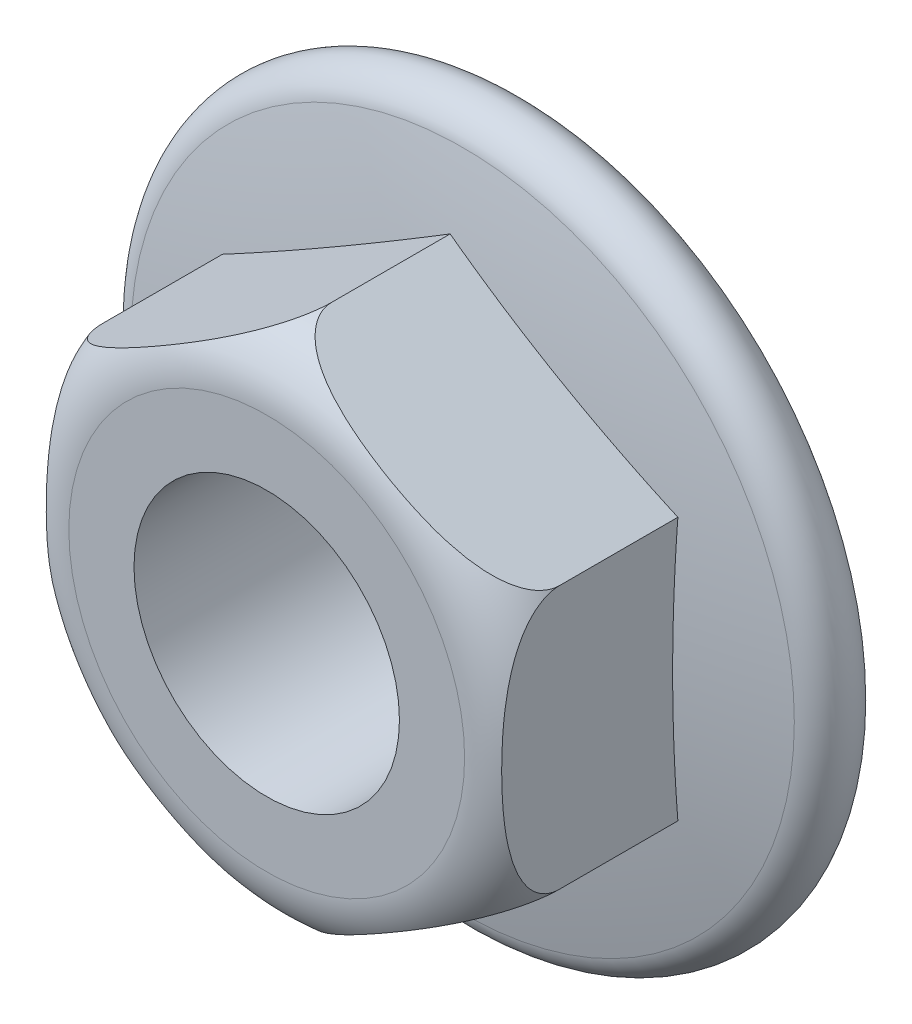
ISO-10303-21;
HEADER;
FILE_DESCRIPTION(('STEP AP214'),'2;1');
FILE_NAME('part.step','',(''),(''),'','','');
FILE_SCHEMA(('AUTOMOTIVE_DESIGN { 1 0 10303 214 1 1 1 1 }'));
ENDSEC;
DATA;
#1=APPLICATION_CONTEXT('core data for automotive mechanical design processes');
#2=APPLICATION_PROTOCOL_DEFINITION('international standard','automotive_design',2000,#1);
#3=PRODUCT_CONTEXT('',#1,'mechanical');
#4=PRODUCT('Part','Part','',(#3));
#5=PRODUCT_RELATED_PRODUCT_CATEGORY('part','',(#4));
#6=PRODUCT_DEFINITION_FORMATION('','',#4);
#7=PRODUCT_DEFINITION_CONTEXT('part definition',#1,'design');
#8=PRODUCT_DEFINITION('design','',#6,#7);
#9=PRODUCT_DEFINITION_SHAPE('','',#8);
#10=(LENGTH_UNIT() NAMED_UNIT(*) SI_UNIT(.MILLI.,.METRE.));
#11=(NAMED_UNIT(*) PLANE_ANGLE_UNIT() SI_UNIT($,.RADIAN.));
#12=(NAMED_UNIT(*) SI_UNIT($,.STERADIAN.) SOLID_ANGLE_UNIT());
#13=UNCERTAINTY_MEASURE_WITH_UNIT(LENGTH_MEASURE(1.E-05),#10,'distance_accuracy_value','');
#14=(GEOMETRIC_REPRESENTATION_CONTEXT(3) GLOBAL_UNCERTAINTY_ASSIGNED_CONTEXT((#13)) GLOBAL_UNIT_ASSIGNED_CONTEXT((#10,
#11,#12)) REPRESENTATION_CONTEXT('',''));
#15=CARTESIAN_POINT('',(0.,0.,0.));
#16=DIRECTION('',(0.,0.,1.));
#17=DIRECTION('',(1.,0.,0.));
#18=AXIS2_PLACEMENT_3D('',#15,#16,#17);
#19=CARTESIAN_POINT('',(-3.50000000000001,2.02072594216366,4.));
#20=DIRECTION('',(-0.500000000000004,0.866025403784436,0.));
#21=DIRECTION('',(-0.866025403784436,-0.500000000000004,0.));
#22=AXIS2_PLACEMENT_3D('',#19,#20,#21);
#23=PLANE('',#22);
#24=DIRECTION('',(0.,0.,-1.));
#25=VECTOR('',#24,1.);
#26=CARTESIAN_POINT('',(-3.50000000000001,2.02072594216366,4.));
#27=LINE('',#26,#25);
#28=CARTESIAN_POINT('',(-3.50000000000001,2.02072594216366,3.));
#29=VERTEX_POINT('',#28);
#30=CARTESIAN_POINT('',(-3.50000000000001,2.02072594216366,1.18087034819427));
#31=VERTEX_POINT('',#30);
#32=EDGE_CURVE('E36',#29,#31,#27,.T.);
#33=ORIENTED_EDGE('',*,*,#32,.F.);
#34=CARTESIAN_POINT('',(-3.499999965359,2.02072596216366,2.9998));
#35=CARTESIAN_POINT('',(-3.50006541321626,2.02068817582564,3.02946004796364));
#36=CARTESIAN_POINT('',(-3.497738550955,2.02203159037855,3.05905658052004));
#37=CARTESIAN_POINT('',(-3.48877331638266,2.02720767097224,3.11713737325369));
#38=CARTESIAN_POINT('',(-3.48216877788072,2.03102080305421,3.14562851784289));
#39=CARTESIAN_POINT('',(-3.46512873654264,2.04085887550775,3.20093447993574));
#40=CARTESIAN_POINT('',(-3.45470238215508,2.04687853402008,3.22775312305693));
#41=CARTESIAN_POINT('',(-3.43063992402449,2.06077100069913,3.27943202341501));
#42=CARTESIAN_POINT('',(-3.41699729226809,2.06864757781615,3.30428815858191));
#43=CARTESIAN_POINT('',(-3.37857137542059,2.09083279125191,3.36543474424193));
#44=CARTESIAN_POINT('',(-3.35188084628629,2.10624257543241,3.40012716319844));
#45=CARTESIAN_POINT('',(-3.2941277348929,2.13958634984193,3.46423943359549));
#46=CARTESIAN_POINT('',(-3.26305460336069,2.15752643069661,3.49364616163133));
#47=CARTESIAN_POINT('',(-3.17696368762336,2.20723104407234,3.56519618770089));
#48=CARTESIAN_POINT('',(-3.11944581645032,2.24043900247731,3.60329409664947));
#49=CARTESIAN_POINT('',(-3.000331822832,2.3092094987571,3.66943708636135));
#50=CARTESIAN_POINT('',(-2.93872771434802,2.34477664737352,3.69746175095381));
#51=CARTESIAN_POINT('',(-2.79342836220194,2.42866526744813,3.75351666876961));
#52=CARTESIAN_POINT('',(-2.70893292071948,2.47744873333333,3.77871981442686));
#53=CARTESIAN_POINT('',(-2.53819605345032,2.57602370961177,3.81977186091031));
#54=CARTESIAN_POINT('',(-2.45195123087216,2.62581718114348,3.83560030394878));
#55=CARTESIAN_POINT('',(-2.27807380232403,2.72620536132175,3.8605608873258));
#56=CARTESIAN_POINT('',(-2.19043561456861,2.77680329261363,3.86963887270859));
#57=CARTESIAN_POINT('',(-2.01497662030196,2.87810459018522,3.88252309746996));
#58=CARTESIAN_POINT('',(-1.92715607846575,2.92880780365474,3.88633451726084));
#59=CARTESIAN_POINT('',(-1.74407122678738,3.03451189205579,3.88956421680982));
#60=CARTESIAN_POINT('',(-1.64880182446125,3.08951570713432,3.88858622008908));
#61=CARTESIAN_POINT('',(-1.45831651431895,3.19949245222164,3.88109833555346));
#62=CARTESIAN_POINT('',(-1.3631007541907,3.25446529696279,3.87458294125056));
#63=CARTESIAN_POINT('',(-1.17405890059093,3.36360866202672,3.85466572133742));
#64=CARTESIAN_POINT('',(-1.08022803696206,3.41778193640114,3.84132691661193));
#65=CARTESIAN_POINT('',(-0.894006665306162,3.52529689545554,3.80514232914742));
#66=CARTESIAN_POINT('',(-0.801613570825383,3.57864007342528,3.78231634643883));
#67=CARTESIAN_POINT('',(-0.663179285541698,3.65856514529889,3.73693902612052));
#68=CARTESIAN_POINT('',(-0.615921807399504,3.68584926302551,3.71938388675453));
#69=CARTESIAN_POINT('',(-0.522814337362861,3.73960488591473,3.67952045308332));
#70=CARTESIAN_POINT('',(-0.47696664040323,3.7660750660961,3.65720483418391));
#71=CARTESIAN_POINT('',(-0.3873121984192,3.81783708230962,3.60659866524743));
#72=CARTESIAN_POINT('',(-0.343524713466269,3.84311779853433,3.57826174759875));
#73=CARTESIAN_POINT('',(-0.25997627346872,3.89135451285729,3.51449392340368));
#74=CARTESIAN_POINT('',(-0.22020674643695,3.91431545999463,3.47907862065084));
#75=CARTESIAN_POINT('',(-0.160686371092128,3.94867956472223,3.41460554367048));
#76=CARTESIAN_POINT('',(-0.138952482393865,3.96122763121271,3.38800019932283));
#77=CARTESIAN_POINT('',(-0.0990712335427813,3.9842530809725,3.33138585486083));
#78=CARTESIAN_POINT('',(-0.0809205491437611,3.99473238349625,3.30138005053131));
#79=CARTESIAN_POINT('',(-0.0516575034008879,4.01162741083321,3.24278652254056));
#80=CARTESIAN_POINT('',(-0.0399052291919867,4.01841258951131,3.21462807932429));
#81=CARTESIAN_POINT('',(-0.0206385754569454,4.02953619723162,3.15645553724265));
#82=CARTESIAN_POINT('',(-0.0131151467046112,4.03387985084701,3.12644555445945));
#83=CARTESIAN_POINT('',(-0.00534902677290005,4.03836362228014,3.08009860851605));
#84=CARTESIAN_POINT('',(-0.00334490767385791,4.03952070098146,3.06413628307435));
#85=CARTESIAN_POINT('',(-0.000665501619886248,4.04106765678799,3.03205266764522));
#86=CARTESIAN_POINT('',(8.84533406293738E-06,4.04145699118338,3.01593127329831));
#87=CARTESIAN_POINT('',(-3.46410176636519E-08,4.04145186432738,2.9998));
#88=B_SPLINE_CURVE_WITH_KNOTS('',3,(#34,#35,#36,#37,#38,#39,#40,#41,#42,#43,#44,#45,#46,#47,#48,
#49,#50,#51,#52,#53,#54,#55,#56,#57,#58,#59,#60,#61,#62,#63,#64,#65,#66,#67,#68,#69,#70,#71,#72,
#73,#74,#75,#76,#77,#78,#79,#80,#81,#82,#83,#84,#85,#86,#87),.UNSPECIFIED.,.F.,.F.,(4,2,2,2,2,2,
2,2,2,2,2,2,2,2,2,2,2,2,2,2,2,2,2,2,2,2,4),(0.,0.0887549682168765,0.176816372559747,
0.264668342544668,0.352700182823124,0.491116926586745,0.629872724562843,0.858271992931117,
1.08713159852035,1.38870326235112,1.69093062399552,1.99555716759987,2.29988385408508,
2.62979570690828,2.96003601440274,3.287279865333,3.61384415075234,3.78564861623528,
3.95771935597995,4.13116655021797,4.30423552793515,4.41365097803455,4.52296443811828,
4.61636709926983,4.70956912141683,4.75789060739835,4.80624623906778),.UNSPECIFIED.);
#89=CARTESIAN_POINT('',(0.,4.04145188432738,3.));
#90=VERTEX_POINT('',#89);
#91=EDGE_CURVE('E83',#29,#90,#88,.T.);
#92=ORIENTED_EDGE('',*,*,#91,.T.);
#93=DIRECTION('',(0.,0.,-1.));
#94=VECTOR('',#93,1.);
#95=CARTESIAN_POINT('',(0.,4.04145188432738,4.));
#96=LINE('',#95,#94);
#97=CARTESIAN_POINT('',(0.,4.04145188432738,1.18087034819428));
#98=VERTEX_POINT('',#97);
#99=EDGE_CURVE('E90',#90,#98,#96,.T.);
#100=ORIENTED_EDGE('',*,*,#99,.T.);
#101=CARTESIAN_POINT('',(-1.75000000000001,3.03108891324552,-24.25));
#102=DIRECTION('',(-0.500000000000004,0.866025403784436,0.));
#103=DIRECTION('',(-0.866025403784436,-0.500000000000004,0.));
#104=AXIS2_PLACEMENT_3D('',#101,#102,#103);
#105=CIRCLE('',#104,25.5110270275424);
#106=EDGE_CURVE('E98',#31,#98,#105,.T.);
#107=ORIENTED_EDGE('',*,*,#106,.F.);
#108=EDGE_LOOP('',(#33,#92,#100,#107));
#109=FACE_BOUND('',#108,.T.);
#110=ADVANCED_FACE('F28',(#109),#23,.T.);
#111=CARTESIAN_POINT('',(-3.50000000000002,-2.0207259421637,4.));
#112=DIRECTION('',(-1.,0.,0.));
#113=DIRECTION('',(0.,-1.,0.));
#114=AXIS2_PLACEMENT_3D('',#111,#112,#113);
#115=PLANE('',#114);
#116=DIRECTION('',(0.,0.,-1.));
#117=VECTOR('',#116,1.);
#118=CARTESIAN_POINT('',(-3.50000000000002,-2.0207259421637,4.));
#119=LINE('',#118,#117);
#120=CARTESIAN_POINT('',(-3.49999999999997,-2.02072594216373,3.));
#121=VERTEX_POINT('',#120);
#122=CARTESIAN_POINT('',(-3.50000000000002,-2.0207259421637,1.18087034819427));
#123=VERTEX_POINT('',#122);
#124=EDGE_CURVE('E107',#121,#123,#119,.T.);
#125=ORIENTED_EDGE('',*,*,#124,.F.);
#126=CARTESIAN_POINT('',(-3.50000000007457,0.,3.88866958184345));
#127=CARTESIAN_POINT('',(-3.50000000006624,0.086326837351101,3.88866475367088));
#128=CARTESIAN_POINT('',(-3.50000000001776,0.172651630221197,3.88703903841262));
#129=CARTESIAN_POINT('',(-3.49999999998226,0.345200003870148,3.88029865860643));
#130=CARTESIAN_POINT('',(-3.49999999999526,0.431423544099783,3.87518289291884));
#131=CARTESIAN_POINT('',(-3.50000000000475,0.603354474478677,3.86079550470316));
#132=CARTESIAN_POINT('',(-3.50000000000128,0.689062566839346,3.851532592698));
#133=CARTESIAN_POINT('',(-3.49999999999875,0.859711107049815,3.82768385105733));
#134=CARTESIAN_POINT('',(-3.4999999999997,0.944652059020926,3.81310182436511));
#135=CARTESIAN_POINT('',(-3.50000000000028,1.10047939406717,3.77956527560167));
#136=CARTESIAN_POINT('',(-3.50000000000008,1.17157101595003,3.76158840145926));
#137=CARTESIAN_POINT('',(-3.49999999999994,1.3119800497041,3.71895615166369));
#138=CARTESIAN_POINT('',(-3.49999999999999,1.38129291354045,3.69428522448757));
#139=CARTESIAN_POINT('',(-3.50000000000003,1.51730819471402,3.63592514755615));
#140=CARTESIAN_POINT('',(-3.50000000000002,1.58395793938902,3.60210997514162));
#141=CARTESIAN_POINT('',(-3.50000000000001,1.71012924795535,3.52311771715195));
#142=CARTESIAN_POINT('',(-3.50000000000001,1.76969019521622,3.47800819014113));
#143=CARTESIAN_POINT('',(-3.50000000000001,1.84774561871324,3.4014522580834));
#144=CARTESIAN_POINT('',(-3.50000000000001,1.87138500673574,3.37526367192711));
#145=CARTESIAN_POINT('',(-3.50000000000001,1.91465839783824,3.31970869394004));
#146=CARTESIAN_POINT('',(-3.50000000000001,1.93429275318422,3.29034258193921));
#147=CARTESIAN_POINT('',(-3.50000000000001,1.96851600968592,3.22831622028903));
#148=CARTESIAN_POINT('',(-3.50000000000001,1.98304564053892,3.19562261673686));
#149=CARTESIAN_POINT('',(-3.50000000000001,2.00542501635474,3.12802070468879));
#150=CARTESIAN_POINT('',(-3.50000000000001,2.01328508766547,3.09311591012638));
#151=CARTESIAN_POINT('',(-3.50000000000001,2.02095945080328,3.02693329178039));
#152=CARTESIAN_POINT('',(-3.50000000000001,2.02166949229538,2.99575843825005));
#153=CARTESIAN_POINT('',(-3.50000000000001,2.01730141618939,2.9338194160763));
#154=CARTESIAN_POINT('',(-3.50000000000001,2.01222343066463,2.90305523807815));
#155=CARTESIAN_POINT('',(-3.50000000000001,1.99739983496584,2.84550196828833));
#156=CARTESIAN_POINT('',(-3.50000000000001,1.988089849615,2.81859776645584));
#157=CARTESIAN_POINT('',(-3.50000000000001,1.9656133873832,2.76647205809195));
#158=CARTESIAN_POINT('',(-3.50000000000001,1.95244609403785,2.74125090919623));
#159=CARTESIAN_POINT('',(-3.50000000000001,1.91585963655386,2.68119414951));
#160=CARTESIAN_POINT('',(-3.50000000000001,1.89054654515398,2.64751269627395));
#161=CARTESIAN_POINT('',(-3.50000000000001,1.83488053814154,2.58459756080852));
#162=CARTESIAN_POINT('',(-3.50000000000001,1.80451416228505,2.55537616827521));
#163=CARTESIAN_POINT('',(-3.50000000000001,1.72189631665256,2.48560726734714));
#164=CARTESIAN_POINT('',(-3.50000000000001,1.66706197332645,2.44814200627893));
#165=CARTESIAN_POINT('',(-3.50000000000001,1.55256598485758,2.38180725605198));
#166=CARTESIAN_POINT('',(-3.50000000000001,1.49289865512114,2.35294808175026));
#167=CARTESIAN_POINT('',(-3.50000000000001,1.37212120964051,2.30262557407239));
#168=CARTESIAN_POINT('',(-3.50000000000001,1.31107157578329,2.28101370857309));
#169=CARTESIAN_POINT('',(-3.50000000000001,1.18734677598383,2.24298388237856));
#170=CARTESIAN_POINT('',(-3.50000000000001,1.1246699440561,2.2265714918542));
#171=CARTESIAN_POINT('',(-3.50000000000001,0.997959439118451,2.1978153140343));
#172=CARTESIAN_POINT('',(-3.50000000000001,0.933919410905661,2.1855001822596));
#173=CARTESIAN_POINT('',(-3.50000000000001,0.805330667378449,2.16427101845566));
#174=CARTESIAN_POINT('',(-3.50000000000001,0.740782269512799,2.15535501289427));
#175=CARTESIAN_POINT('',(-3.50000000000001,0.598058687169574,2.13873267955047));
#176=CARTESIAN_POINT('',(-3.50000000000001,0.519811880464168,2.1316525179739));
#177=CARTESIAN_POINT('',(-3.50000000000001,0.363081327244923,2.12073868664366));
#178=CARTESIAN_POINT('',(-3.50000000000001,0.284597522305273,2.11690589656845));
#179=CARTESIAN_POINT('',(-3.50000000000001,0.127339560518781,2.11205625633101));
#180=CARTESIAN_POINT('',(-3.50000000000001,0.0485651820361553,2.11104681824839));
#181=CARTESIAN_POINT('',(-3.50000000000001,-0.108959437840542,2.11174847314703));
#182=CARTESIAN_POINT('',(-3.50000000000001,-0.187709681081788,2.11345913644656));
#183=CARTESIAN_POINT('',(-3.50000000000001,-0.344482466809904,2.11977175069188));
#184=CARTESIAN_POINT('',(-3.50000000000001,-0.422505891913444,2.12435103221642));
#185=CARTESIAN_POINT('',(-3.50000000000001,-0.578320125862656,2.13688479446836));
#186=CARTESIAN_POINT('',(-3.50000000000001,-0.656110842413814,2.14484047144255));
#187=CARTESIAN_POINT('',(-3.50000000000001,-0.810862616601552,2.16492355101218));
#188=CARTESIAN_POINT('',(-3.50000000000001,-0.887825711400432,2.17703484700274));
#189=CARTESIAN_POINT('',(-3.50000000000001,-1.04069181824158,2.20662161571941));
#190=CARTESIAN_POINT('',(-3.50000000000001,-1.11659576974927,2.22409197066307));
#191=CARTESIAN_POINT('',(-3.50000000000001,-1.22622138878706,2.2547875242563));
#192=CARTESIAN_POINT('',(-3.50000000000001,-1.26071408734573,2.2652572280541));
#193=CARTESIAN_POINT('',(-3.50000000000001,-1.3291362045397,2.28791589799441));
#194=CARTESIAN_POINT('',(-3.50000000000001,-1.36306544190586,2.30010540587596));
#195=CARTESIAN_POINT('',(-3.50000000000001,-1.46365216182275,2.33955916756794));
#196=CARTESIAN_POINT('',(-3.50000000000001,-1.52924178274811,2.36974387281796));
#197=CARTESIAN_POINT('',(-3.50000000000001,-1.63826125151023,2.43070580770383));
#198=CARTESIAN_POINT('',(-3.50000000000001,-1.68295511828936,2.45920328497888));
#199=CARTESIAN_POINT('',(-3.50000000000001,-1.7676805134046,2.52254240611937));
#200=CARTESIAN_POINT('',(-3.50000000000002,-1.80771883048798,2.55737461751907));
#201=CARTESIAN_POINT('',(-3.50000000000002,-1.86880478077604,2.62179662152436));
#202=CARTESIAN_POINT('',(-3.50000000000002,-1.89183062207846,2.64950003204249));
#203=CARTESIAN_POINT('',(-3.50000000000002,-1.93330435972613,2.70815552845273));
#204=CARTESIAN_POINT('',(-3.50000000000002,-1.95175915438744,2.73910261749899));
#205=CARTESIAN_POINT('',(-3.50000000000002,-1.98020381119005,2.79847583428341));
#206=CARTESIAN_POINT('',(-3.50000000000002,-1.99108975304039,2.82646951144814));
#207=CARTESIAN_POINT('',(-3.50000000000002,-2.00802811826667,2.88389269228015));
#208=CARTESIAN_POINT('',(-3.50000000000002,-2.01408338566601,2.91332134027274));
#209=CARTESIAN_POINT('',(-3.50000000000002,-2.02088735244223,2.97290689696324));
#210=CARTESIAN_POINT('',(-3.50000000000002,-2.02161631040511,3.003066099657));
#211=CARTESIAN_POINT('',(-3.50000000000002,-2.01765062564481,3.06302342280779));
#212=CARTESIAN_POINT('',(-3.50000000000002,-2.01295539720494,3.09282150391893));
#213=CARTESIAN_POINT('',(-3.50000000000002,-1.9989436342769,3.14951865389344));
#214=CARTESIAN_POINT('',(-3.50000000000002,-1.98990016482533,3.17648665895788));
#215=CARTESIAN_POINT('',(-3.50000000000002,-1.96792176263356,3.22877122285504));
#216=CARTESIAN_POINT('',(-3.50000000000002,-1.95498534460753,3.25408714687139));
#217=CARTESIAN_POINT('',(-3.50000000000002,-1.91910314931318,3.31410022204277));
#218=CARTESIAN_POINT('',(-3.50000000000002,-1.89430007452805,3.34768656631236));
#219=CARTESIAN_POINT('',(-3.50000000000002,-1.83966536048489,3.410475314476));
#220=CARTESIAN_POINT('',(-3.50000000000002,-1.80982214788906,3.43966732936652));
#221=CARTESIAN_POINT('',(-3.50000000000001,-1.72878496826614,3.50921588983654));
#222=CARTESIAN_POINT('',(-3.50000000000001,-1.67504338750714,3.5465812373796));
#223=CARTESIAN_POINT('',(-3.50000000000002,-1.56265233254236,3.61290679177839));
#224=CARTESIAN_POINT('',(-3.50000000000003,-1.50399107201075,3.64184602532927));
#225=CARTESIAN_POINT('',(-3.5,-1.3854732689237,3.69227368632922));
#226=CARTESIAN_POINT('',(-3.49999999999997,-1.32569142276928,3.71394172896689));
#227=CARTESIAN_POINT('',(-3.50000000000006,-1.2044897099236,3.75217091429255));
#228=CARTESIAN_POINT('',(-3.50000000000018,-1.14306820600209,3.76872672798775));
#229=CARTESIAN_POINT('',(-3.49999999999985,-1.01920506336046,3.79774633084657));
#230=CARTESIAN_POINT('',(-3.49999999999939,-0.956762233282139,3.8102049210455));
#231=CARTESIAN_POINT('',(-3.50000000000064,-0.831296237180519,3.83179537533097));
#232=CARTESIAN_POINT('',(-3.50000000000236,-0.768272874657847,3.84092606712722));
#233=CARTESIAN_POINT('',(-3.49999999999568,-0.588181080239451,3.86310397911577));
#234=CARTESIAN_POINT('',(-3.49999999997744,-0.470713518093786,3.87288227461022));
#235=CARTESIAN_POINT('',(-3.50000000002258,-0.235495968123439,3.88566728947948));
#236=CARTESIAN_POINT('',(-3.50000000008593,-0.117746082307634,3.88867616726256));
#237=CARTESIAN_POINT('',(-3.50000000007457,0.,3.88866958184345));
#238=B_SPLINE_CURVE_WITH_KNOTS('',3,(#126,#127,#128,#129,#130,#131,#132,#133,#134,#135,#136,
#137,#138,#139,#140,#141,#142,#143,#144,#145,#146,#147,#148,#149,#150,#151,#152,#153,#154,#155,
#156,#157,#158,#159,#160,#161,#162,#163,#164,#165,#166,#167,#168,#169,#170,#171,#172,#173,#174,
#175,#176,#177,#178,#179,#180,#181,#182,#183,#184,#185,#186,#187,#188,#189,#190,#191,#192,#193,
#194,#195,#196,#197,#198,#199,#200,#201,#202,#203,#204,#205,#206,#207,#208,#209,#210,#211,#212,
#213,#214,#215,#216,#217,#218,#219,#220,#221,#222,#223,#224,#225,#226,#227,#228,#229,#230,#231,
#232,#233,#234,#235,#236,#237),.UNSPECIFIED.,.T.,.F.,(4,2,2,2,2,2,2,2,2,2,2,2,2,2,2,2,2,2,2,2,2,
2,2,2,2,2,2,2,2,2,2,2,2,2,2,2,2,2,2,2,2,2,2,2,2,2,2,2,2,2,2,2,2,2,2,4),(0.,0.25896048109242,
0.518002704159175,0.77650337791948,1.03481959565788,1.25457530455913,1.47484598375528,
1.69832240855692,1.92049274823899,2.02603918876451,2.13157634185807,2.23830124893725,
2.34486061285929,2.43787441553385,2.53088609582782,2.61595499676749,2.70104191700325,
2.82672538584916,2.95274915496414,3.15085859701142,3.34920453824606,3.54319361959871,
3.73738982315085,3.93291697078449,4.12833042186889,4.3639435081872,4.59962039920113,
4.83591542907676,5.07217313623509,5.3065869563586,5.5410838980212,5.77468204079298,
6.00805779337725,6.11615522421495,6.22428678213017,6.44013860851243,6.59875051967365,
6.75712816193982,6.8648515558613,6.972411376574,7.0621419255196,7.15181960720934,
7.24182950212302,7.3318491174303,7.41683554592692,7.50185444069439,7.6264019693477,
7.75123947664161,7.94649755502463,8.14223757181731,8.33270789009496,8.52337608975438,
8.71428530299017,8.90526170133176,9.25858529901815,9.61179622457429),.UNSPECIFIED.);
#239=EDGE_CURVE('E93',#121,#29,#238,.T.);
#240=ORIENTED_EDGE('',*,*,#239,.T.);
#241=ORIENTED_EDGE('',*,*,#32,.T.);
#242=CARTESIAN_POINT('',(-3.50000000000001,0.,-24.25));
#243=DIRECTION('',(-1.,0.,0.));
#244=DIRECTION('',(0.,-1.,0.));
#245=AXIS2_PLACEMENT_3D('',#242,#243,#244);
#246=CIRCLE('',#245,25.5110270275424);
#247=EDGE_CURVE('E101',#123,#31,#246,.T.);
#248=ORIENTED_EDGE('',*,*,#247,.F.);
#249=EDGE_LOOP('',(#125,#240,#241,#248));
#250=FACE_BOUND('',#249,.T.);
#251=ADVANCED_FACE('F172',(#250),#115,.T.);
#252=CARTESIAN_POINT('',(0.,-4.04145188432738,4.));
#253=DIRECTION('',(-0.499999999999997,-0.86602540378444,0.));
#254=DIRECTION('',(0.86602540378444,-0.499999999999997,0.));
#255=AXIS2_PLACEMENT_3D('',#252,#253,#254);
#256=PLANE('',#255);
#257=DIRECTION('',(0.,0.,-1.));
#258=VECTOR('',#257,1.);
#259=CARTESIAN_POINT('',(0.,-4.04145188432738,4.));
#260=LINE('',#259,#258);
#261=CARTESIAN_POINT('',(0.,-4.04145188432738,3.));
#262=VERTEX_POINT('',#261);
#263=CARTESIAN_POINT('',(0.,-4.04145188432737,1.18087034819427));
#264=VERTEX_POINT('',#263);
#265=EDGE_CURVE('E105',#262,#264,#260,.T.);
#266=ORIENTED_EDGE('',*,*,#265,.F.);
#267=CARTESIAN_POINT('',(-3.46410372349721E-08,-4.04145186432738,2.9998));
#268=CARTESIAN_POINT('',(6.54132162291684E-05,-4.04148965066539,3.02946004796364));
#269=CARTESIAN_POINT('',(-0.00226144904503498,-4.04014623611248,3.05905658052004));
#270=CARTESIAN_POINT('',(-0.0112266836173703,-4.03497015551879,3.11713737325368));
#271=CARTESIAN_POINT('',(-0.0178312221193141,-4.03115702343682,3.14562851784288));
#272=CARTESIAN_POINT('',(-0.0348712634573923,-4.02131895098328,3.20093447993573));
#273=CARTESIAN_POINT('',(-0.0452976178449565,-4.01529929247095,3.22775312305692));
#274=CARTESIAN_POINT('',(-0.0693600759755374,-4.0014068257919,3.279432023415));
#275=CARTESIAN_POINT('',(-0.0830027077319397,-3.99353024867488,3.3042881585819));
#276=CARTESIAN_POINT('',(-0.121428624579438,-3.97134503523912,3.36543474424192));
#277=CARTESIAN_POINT('',(-0.148119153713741,-3.95593525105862,3.40012716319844));
#278=CARTESIAN_POINT('',(-0.205872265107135,-3.92259147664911,3.46423943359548));
#279=CARTESIAN_POINT('',(-0.236945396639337,-3.90465139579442,3.49364616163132));
#280=CARTESIAN_POINT('',(-0.323036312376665,-3.8549467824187,3.56519618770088));
#281=CARTESIAN_POINT('',(-0.380554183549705,-3.82173882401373,3.60329409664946));
#282=CARTESIAN_POINT('',(-0.49966817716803,-3.75296832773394,3.66943708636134));
#283=CARTESIAN_POINT('',(-0.561272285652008,-3.71740117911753,3.6974617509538));
#284=CARTESIAN_POINT('',(-0.706571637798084,-3.63351255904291,3.7535166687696));
#285=CARTESIAN_POINT('',(-0.791067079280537,-3.58472909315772,3.77871981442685));
#286=CARTESIAN_POINT('',(-0.961803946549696,-3.48615411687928,3.81977186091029));
#287=CARTESIAN_POINT('',(-1.04804876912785,-3.43636064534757,3.83560030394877));
#288=CARTESIAN_POINT('',(-1.22192619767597,-3.33597246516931,3.86056088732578));
#289=CARTESIAN_POINT('',(-1.3095643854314,-3.28537453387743,3.86963887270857));
#290=CARTESIAN_POINT('',(-1.48502337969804,-3.18407323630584,3.88252309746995));
#291=CARTESIAN_POINT('',(-1.57284392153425,-3.13337002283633,3.88633451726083));
#292=CARTESIAN_POINT('',(-1.75592877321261,-3.02766593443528,3.8895642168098));
#293=CARTESIAN_POINT('',(-1.85119817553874,-2.97266211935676,3.88858622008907));
#294=CARTESIAN_POINT('',(-2.04168348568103,-2.86268537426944,3.88109833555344));
#295=CARTESIAN_POINT('',(-2.13689924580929,-2.8077125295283,3.87458294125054));
#296=CARTESIAN_POINT('',(-2.32594109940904,-2.69856916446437,3.85466572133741));
#297=CARTESIAN_POINT('',(-2.41977196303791,-2.64439589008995,3.84132691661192));
#298=CARTESIAN_POINT('',(-2.60599333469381,-2.53688093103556,3.80514232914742));
#299=CARTESIAN_POINT('',(-2.69838642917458,-2.48353775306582,3.78231634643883));
#300=CARTESIAN_POINT('',(-2.83682071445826,-2.40361268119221,3.73693902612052));
#301=CARTESIAN_POINT('',(-2.88407819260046,-2.3763285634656,3.71938388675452));
#302=CARTESIAN_POINT('',(-2.9771856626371,-2.32257294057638,3.67952045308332));
#303=CARTESIAN_POINT('',(-3.02303335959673,-2.29610276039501,3.6572048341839));
#304=CARTESIAN_POINT('',(-3.11268780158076,-2.24434074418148,3.60659866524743));
#305=CARTESIAN_POINT('',(-3.1564752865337,-2.21906002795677,3.57826174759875));
#306=CARTESIAN_POINT('',(-3.24002372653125,-2.17082331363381,3.51449392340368));
#307=CARTESIAN_POINT('',(-3.27979325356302,-2.14786236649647,3.47907862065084));
#308=CARTESIAN_POINT('',(-3.33931362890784,-2.11349826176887,3.41460554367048));
#309=CARTESIAN_POINT('',(-3.3610475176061,-2.10095019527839,3.38800019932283));
#310=CARTESIAN_POINT('',(-3.40092876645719,-2.0779247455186,3.33138585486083));
#311=CARTESIAN_POINT('',(-3.41907945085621,-2.06744544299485,3.30138005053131));
#312=CARTESIAN_POINT('',(-3.44834249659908,-2.0505504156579,3.24278652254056));
#313=CARTESIAN_POINT('',(-3.46009477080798,-2.0437652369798,3.2146280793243));
#314=CARTESIAN_POINT('',(-3.47936142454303,-2.03264162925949,3.15645553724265));
#315=CARTESIAN_POINT('',(-3.48688485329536,-2.0282979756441,3.12644555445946));
#316=CARTESIAN_POINT('',(-3.49465097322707,-2.02381420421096,3.08009860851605));
#317=CARTESIAN_POINT('',(-3.49665509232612,-2.02265712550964,3.06413628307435));
#318=CARTESIAN_POINT('',(-3.49933449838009,-2.02111016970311,3.03205266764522));
#319=CARTESIAN_POINT('',(-3.50000884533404,-2.02072083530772,3.01593127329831));
#320=CARTESIAN_POINT('',(-3.49999996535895,-2.02072596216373,2.9998));
#321=B_SPLINE_CURVE_WITH_KNOTS('',3,(#267,#268,#269,#270,#271,#272,#273,#274,#275,#276,#277,
#278,#279,#280,#281,#282,#283,#284,#285,#286,#287,#288,#289,#290,#291,#292,#293,#294,#295,#296,
#297,#298,#299,#300,#301,#302,#303,#304,#305,#306,#307,#308,#309,#310,#311,#312,#313,#314,#315,
#316,#317,#318,#319,#320),.UNSPECIFIED.,.F.,.F.,(4,2,2,2,2,2,2,2,2,2,2,2,2,2,2,2,2,2,2,2,2,2,2,
2,2,2,4),(0.,0.0887549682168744,0.176816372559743,0.264668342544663,0.352700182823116,
0.491116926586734,0.629872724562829,0.858271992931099,1.08713159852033,1.38870326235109,
1.69093062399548,1.99555716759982,2.29988385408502,2.62979570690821,2.96003601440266,
3.28727986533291,3.61384415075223,3.78564861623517,3.95771935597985,4.13116655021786,
4.30423552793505,4.41365097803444,4.52296443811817,4.61636709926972,4.70956912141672,
4.75789060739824,4.80624623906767),.UNSPECIFIED.);
#322=EDGE_CURVE('E162',#262,#121,#321,.T.);
#323=ORIENTED_EDGE('',*,*,#322,.T.);
#324=ORIENTED_EDGE('',*,*,#124,.T.);
#325=CARTESIAN_POINT('',(-1.74999999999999,-3.03108891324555,-24.25));
#326=DIRECTION('',(-0.499999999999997,-0.86602540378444,0.));
#327=DIRECTION('',(0.86602540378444,-0.499999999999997,0.));
#328=AXIS2_PLACEMENT_3D('',#325,#326,#327);
#329=CIRCLE('',#328,25.5110270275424);
#330=EDGE_CURVE('E112',#264,#123,#329,.T.);
#331=ORIENTED_EDGE('',*,*,#330,.F.);
#332=EDGE_LOOP('',(#266,#323,#324,#331));
#333=FACE_BOUND('',#332,.T.);
#334=ADVANCED_FACE('F168',(#333),#256,.T.);
#335=CARTESIAN_POINT('',(3.49999999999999,-2.0207259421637,4.));
#336=DIRECTION('',(0.499999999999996,-0.866025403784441,0.));
#337=DIRECTION('',(0.866025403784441,0.499999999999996,0.));
#338=AXIS2_PLACEMENT_3D('',#335,#336,#337);
#339=PLANE('',#338);
#340=DIRECTION('',(0.,0.,-1.));
#341=VECTOR('',#340,1.);
#342=CARTESIAN_POINT('',(3.49999999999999,-2.0207259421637,4.));
#343=LINE('',#342,#341);
#344=CARTESIAN_POINT('',(3.49999999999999,-2.0207259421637,3.));
#345=VERTEX_POINT('',#344);
#346=CARTESIAN_POINT('',(3.49999999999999,-2.0207259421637,1.18087034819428));
#347=VERTEX_POINT('',#346);
#348=EDGE_CURVE('E99',#345,#347,#343,.T.);
#349=ORIENTED_EDGE('',*,*,#348,.F.);
#350=CARTESIAN_POINT('',(3.49999996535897,-2.0207259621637,2.9998));
#351=CARTESIAN_POINT('',(3.50006541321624,-2.02068817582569,3.02946004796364));
#352=CARTESIAN_POINT('',(3.49773855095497,-2.0220315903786,3.05905658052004));
#353=CARTESIAN_POINT('',(3.48877331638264,-2.02720767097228,3.11713737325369));
#354=CARTESIAN_POINT('',(3.48216877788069,-2.03102080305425,3.14562851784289));
#355=CARTESIAN_POINT('',(3.46512873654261,-2.0408588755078,3.20093447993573));
#356=CARTESIAN_POINT('',(3.45470238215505,-2.04687853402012,3.22775312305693));
#357=CARTESIAN_POINT('',(3.43063992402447,-2.06077100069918,3.27943202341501));
#358=CARTESIAN_POINT('',(3.41699729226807,-2.06864757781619,3.3042881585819));
#359=CARTESIAN_POINT('',(3.37857137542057,-2.09083279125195,3.36543474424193));
#360=CARTESIAN_POINT('',(3.35188084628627,-2.10624257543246,3.40012716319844));
#361=CARTESIAN_POINT('',(3.29412773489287,-2.13958634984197,3.46423943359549));
#362=CARTESIAN_POINT('',(3.26305460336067,-2.15752643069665,3.49364616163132));
#363=CARTESIAN_POINT('',(3.17696368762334,-2.20723104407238,3.56519618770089));
#364=CARTESIAN_POINT('',(3.1194458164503,-2.24043900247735,3.60329409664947));
#365=CARTESIAN_POINT('',(3.00033182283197,-2.30920949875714,3.66943708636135));
#366=CARTESIAN_POINT('',(2.93872771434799,-2.34477664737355,3.69746175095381));
#367=CARTESIAN_POINT('',(2.79342836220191,-2.42866526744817,3.75351666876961));
#368=CARTESIAN_POINT('',(2.70893292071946,-2.47744873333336,3.77871981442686));
#369=CARTESIAN_POINT('',(2.5381960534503,-2.5760237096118,3.8197718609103));
#370=CARTESIAN_POINT('',(2.45195123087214,-2.62581718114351,3.83560030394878));
#371=CARTESIAN_POINT('',(2.27807380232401,-2.72620536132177,3.86056088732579));
#372=CARTESIAN_POINT('',(2.19043561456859,-2.77680329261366,3.86963887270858));
#373=CARTESIAN_POINT('',(2.01497662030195,-2.87810459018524,3.88252309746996));
#374=CARTESIAN_POINT('',(1.92715607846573,-2.92880780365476,3.88633451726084));
#375=CARTESIAN_POINT('',(1.74407122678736,-3.03451189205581,3.88956421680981));
#376=CARTESIAN_POINT('',(1.64880182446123,-3.08951570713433,3.88858622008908));
#377=CARTESIAN_POINT('',(1.45831651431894,-3.19949245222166,3.88109833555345));
#378=CARTESIAN_POINT('',(1.36310075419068,-3.2544652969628,3.87458294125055));
#379=CARTESIAN_POINT('',(1.17405890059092,-3.36360866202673,3.85466572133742));
#380=CARTESIAN_POINT('',(1.08022803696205,-3.41778193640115,3.84132691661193));
#381=CARTESIAN_POINT('',(0.894006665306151,-3.52529689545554,3.80514232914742));
#382=CARTESIAN_POINT('',(0.801613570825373,-3.57864007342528,3.78231634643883));
#383=CARTESIAN_POINT('',(0.663179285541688,-3.65856514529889,3.73693902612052));
#384=CARTESIAN_POINT('',(0.615921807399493,-3.68584926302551,3.71938388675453));
#385=CARTESIAN_POINT('',(0.52281433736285,-3.73960488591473,3.67952045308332));
#386=CARTESIAN_POINT('',(0.476966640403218,-3.7660750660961,3.65720483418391));
#387=CARTESIAN_POINT('',(0.387312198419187,-3.81783708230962,3.60659866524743));
#388=CARTESIAN_POINT('',(0.343524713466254,-3.84311779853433,3.57826174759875));
#389=CARTESIAN_POINT('',(0.259976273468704,-3.89135451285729,3.51449392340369));
#390=CARTESIAN_POINT('',(0.220206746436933,-3.91431545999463,3.47907862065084));
#391=CARTESIAN_POINT('',(0.16068637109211,-3.94867956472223,3.41460554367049));
#392=CARTESIAN_POINT('',(0.138952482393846,-3.96122763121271,3.38800019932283));
#393=CARTESIAN_POINT('',(0.0990712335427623,-3.9842530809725,3.33138585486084));
#394=CARTESIAN_POINT('',(0.0809205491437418,-3.99473238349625,3.30138005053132));
#395=CARTESIAN_POINT('',(0.0516575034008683,-4.01162741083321,3.24278652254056));
#396=CARTESIAN_POINT('',(0.0399052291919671,-4.01841258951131,3.2146280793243));
#397=CARTESIAN_POINT('',(0.0206385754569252,-4.02953619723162,3.15645553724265));
#398=CARTESIAN_POINT('',(0.0131151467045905,-4.03387985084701,3.12644555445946));
#399=CARTESIAN_POINT('',(0.00534902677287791,-4.03836362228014,3.08009860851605));
#400=CARTESIAN_POINT('',(0.00334490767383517,-4.03952070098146,3.06413628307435));
#401=CARTESIAN_POINT('',(0.000665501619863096,-4.04106765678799,3.03205266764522));
#402=CARTESIAN_POINT('',(-8.84533408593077E-06,-4.04145699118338,3.01593127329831));
#403=CARTESIAN_POINT('',(3.4640995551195E-08,-4.04145186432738,2.9998));
#404=B_SPLINE_CURVE_WITH_KNOTS('',3,(#350,#351,#352,#353,#354,#355,#356,#357,#358,#359,#360,
#361,#362,#363,#364,#365,#366,#367,#368,#369,#370,#371,#372,#373,#374,#375,#376,#377,#378,#379,
#380,#381,#382,#383,#384,#385,#386,#387,#388,#389,#390,#391,#392,#393,#394,#395,#396,#397,#398,
#399,#400,#401,#402,#403),.UNSPECIFIED.,.F.,.F.,(4,2,2,2,2,2,2,2,2,2,2,2,2,2,2,2,2,2,2,2,2,2,2,
2,2,2,4),(0.,0.0887549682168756,0.176816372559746,0.264668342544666,0.352700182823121,
0.491116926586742,0.629872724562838,0.85827199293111,1.08713159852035,1.38870326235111,
1.6909306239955,1.99555716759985,2.29988385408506,2.62979570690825,2.96003601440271,
3.28727986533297,3.6138441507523,3.78564861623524,3.95771935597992,4.13116655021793,
4.30423552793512,4.41365097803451,4.52296443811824,4.61636709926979,4.70956912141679,
4.75789060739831,4.80624623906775),.UNSPECIFIED.);
#405=EDGE_CURVE('E157',#345,#262,#404,.T.);
#406=ORIENTED_EDGE('',*,*,#405,.T.);
#407=ORIENTED_EDGE('',*,*,#265,.T.);
#408=CARTESIAN_POINT('',(1.74999999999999,-3.03108891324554,-24.25));
#409=DIRECTION('',(0.499999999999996,-0.866025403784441,0.));
#410=DIRECTION('',(0.866025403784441,0.499999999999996,0.));
#411=AXIS2_PLACEMENT_3D('',#408,#409,#410);
#412=CIRCLE('',#411,25.5110270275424);
#413=EDGE_CURVE('E115',#347,#264,#412,.T.);
#414=ORIENTED_EDGE('',*,*,#413,.F.);
#415=EDGE_LOOP('',(#349,#406,#407,#414));
#416=FACE_BOUND('',#415,.T.);
#417=ADVANCED_FACE('F171',(#416),#339,.T.);
#418=CARTESIAN_POINT('',(3.49999999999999,2.02072594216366,4.));
#419=DIRECTION('',(1.,0.,0.));
#420=DIRECTION('',(0.,1.,0.));
#421=AXIS2_PLACEMENT_3D('',#418,#419,#420);
#422=PLANE('',#421);
#423=DIRECTION('',(0.,0.,-1.));
#424=VECTOR('',#423,1.);
#425=CARTESIAN_POINT('',(3.49999999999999,2.02072594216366,4.));
#426=LINE('',#425,#424);
#427=CARTESIAN_POINT('',(3.49999999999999,2.02072594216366,3.));
#428=VERTEX_POINT('',#427);
#429=CARTESIAN_POINT('',(3.49999999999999,2.02072594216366,1.18087034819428));
#430=VERTEX_POINT('',#429);
#431=EDGE_CURVE('E97',#428,#430,#426,.T.);
#432=ORIENTED_EDGE('',*,*,#431,.F.);
#433=CARTESIAN_POINT('',(3.49999999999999,0.,3.88866958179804));
#434=CARTESIAN_POINT('',(3.49999999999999,-0.0863268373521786,3.88866475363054));
#435=CARTESIAN_POINT('',(3.49999999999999,-0.172651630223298,3.88703903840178));
#436=CARTESIAN_POINT('',(3.49999999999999,-0.345200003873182,3.88029865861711));
#437=CARTESIAN_POINT('',(3.49999999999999,-0.431423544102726,3.87518289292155));
#438=CARTESIAN_POINT('',(3.49999999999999,-0.603354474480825,3.86079550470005));
#439=CARTESIAN_POINT('',(3.49999999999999,-0.689062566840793,3.85153259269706));
#440=CARTESIAN_POINT('',(3.49999999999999,-0.85971110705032,3.82768385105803));
#441=CARTESIAN_POINT('',(3.49999999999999,-0.944652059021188,3.81310182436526));
#442=CARTESIAN_POINT('',(3.49999999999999,-1.10047939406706,3.77956527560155));
#443=CARTESIAN_POINT('',(3.49999999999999,-1.17157101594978,3.7615884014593));
#444=CARTESIAN_POINT('',(3.49999999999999,-1.31198004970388,3.71895615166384));
#445=CARTESIAN_POINT('',(3.49999999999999,-1.38129291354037,3.69428522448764));
#446=CARTESIAN_POINT('',(3.49999999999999,-1.51730819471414,3.63592514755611));
#447=CARTESIAN_POINT('',(3.49999999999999,-1.58395793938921,3.60210997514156));
#448=CARTESIAN_POINT('',(3.49999999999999,-1.71012924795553,3.52311771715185));
#449=CARTESIAN_POINT('',(3.49999999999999,-1.76969019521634,3.47800819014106));
#450=CARTESIAN_POINT('',(3.49999999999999,-1.8477456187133,3.40145225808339));
#451=CARTESIAN_POINT('',(3.49999999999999,-1.8713850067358,3.3752636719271));
#452=CARTESIAN_POINT('',(3.49999999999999,-1.91465839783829,3.31970869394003));
#453=CARTESIAN_POINT('',(3.49999999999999,-1.93429275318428,3.2903425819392));
#454=CARTESIAN_POINT('',(3.49999999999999,-1.96851600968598,3.228316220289));
#455=CARTESIAN_POINT('',(3.49999999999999,-1.98304564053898,3.19562261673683));
#456=CARTESIAN_POINT('',(3.49999999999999,-2.0054250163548,3.12802070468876));
#457=CARTESIAN_POINT('',(3.49999999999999,-2.01328508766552,3.09311591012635));
#458=CARTESIAN_POINT('',(3.49999999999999,-2.02095945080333,3.02693329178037));
#459=CARTESIAN_POINT('',(3.49999999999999,-2.02166949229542,2.99575843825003));
#460=CARTESIAN_POINT('',(3.49999999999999,-2.01730141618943,2.93381941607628));
#461=CARTESIAN_POINT('',(3.49999999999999,-2.01222343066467,2.90305523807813));
#462=CARTESIAN_POINT('',(3.49999999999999,-1.99739983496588,2.84550196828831));
#463=CARTESIAN_POINT('',(3.49999999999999,-1.98808984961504,2.81859776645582));
#464=CARTESIAN_POINT('',(3.49999999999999,-1.96561338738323,2.76647205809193));
#465=CARTESIAN_POINT('',(3.49999999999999,-1.95244609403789,2.74125090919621));
#466=CARTESIAN_POINT('',(3.49999999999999,-1.91585963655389,2.68119414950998));
#467=CARTESIAN_POINT('',(3.49999999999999,-1.89054654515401,2.64751269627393));
#468=CARTESIAN_POINT('',(3.49999999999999,-1.83488053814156,2.58459756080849));
#469=CARTESIAN_POINT('',(3.49999999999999,-1.80451416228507,2.55537616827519));
#470=CARTESIAN_POINT('',(3.49999999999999,-1.72189631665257,2.48560726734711));
#471=CARTESIAN_POINT('',(3.49999999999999,-1.66706197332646,2.4481420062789));
#472=CARTESIAN_POINT('',(3.49999999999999,-1.55256598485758,2.38180725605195));
#473=CARTESIAN_POINT('',(3.49999999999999,-1.49289865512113,2.35294808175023));
#474=CARTESIAN_POINT('',(3.49999999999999,-1.37212120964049,2.30262557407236));
#475=CARTESIAN_POINT('',(3.49999999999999,-1.31107157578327,2.28101370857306));
#476=CARTESIAN_POINT('',(3.49999999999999,-1.18734677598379,2.24298388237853));
#477=CARTESIAN_POINT('',(3.49999999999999,-1.12466994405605,2.22657149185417));
#478=CARTESIAN_POINT('',(3.49999999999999,-0.997959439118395,2.19781531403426));
#479=CARTESIAN_POINT('',(3.49999999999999,-0.933919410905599,2.18550018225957));
#480=CARTESIAN_POINT('',(3.49999999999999,-0.805330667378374,2.16427101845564));
#481=CARTESIAN_POINT('',(3.49999999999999,-0.740782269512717,2.15535501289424));
#482=CARTESIAN_POINT('',(3.49999999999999,-0.598058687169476,2.13873267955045));
#483=CARTESIAN_POINT('',(3.49999999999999,-0.51981188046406,2.13165251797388));
#484=CARTESIAN_POINT('',(3.49999999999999,-0.363081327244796,2.12073868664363));
#485=CARTESIAN_POINT('',(3.49999999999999,-0.284597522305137,2.11690589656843));
#486=CARTESIAN_POINT('',(3.49999999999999,-0.127339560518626,2.11205625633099));
#487=CARTESIAN_POINT('',(3.49999999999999,-0.0485651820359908,2.11104681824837));
#488=CARTESIAN_POINT('',(3.49999999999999,0.108959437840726,2.11174847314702));
#489=CARTESIAN_POINT('',(3.49999999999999,0.187709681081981,2.11345913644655));
#490=CARTESIAN_POINT('',(3.49999999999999,0.344482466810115,2.11977175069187));
#491=CARTESIAN_POINT('',(3.49999999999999,0.422505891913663,2.12435103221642));
#492=CARTESIAN_POINT('',(3.49999999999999,0.578320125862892,2.13688479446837));
#493=CARTESIAN_POINT('',(3.49999999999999,0.656110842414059,2.14484047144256));
#494=CARTESIAN_POINT('',(3.49999999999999,0.810862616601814,2.1649235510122));
#495=CARTESIAN_POINT('',(3.49999999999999,0.887825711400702,2.17703484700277));
#496=CARTESIAN_POINT('',(3.49999999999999,1.04069181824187,2.20662161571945));
#497=CARTESIAN_POINT('',(3.49999999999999,1.11659576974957,2.22409197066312));
#498=CARTESIAN_POINT('',(3.49999999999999,1.22622138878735,2.25478752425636));
#499=CARTESIAN_POINT('',(3.49999999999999,1.260714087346,2.26525722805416));
#500=CARTESIAN_POINT('',(3.49999999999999,1.32913620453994,2.28791589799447));
#501=CARTESIAN_POINT('',(3.49999999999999,1.3630654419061,2.30010540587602));
#502=CARTESIAN_POINT('',(3.49999999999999,1.46365216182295,2.339559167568));
#503=CARTESIAN_POINT('',(3.49999999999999,1.52924178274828,2.36974387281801));
#504=CARTESIAN_POINT('',(3.49999999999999,1.63826125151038,2.43070580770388));
#505=CARTESIAN_POINT('',(3.49999999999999,1.6829551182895,2.45920328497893));
#506=CARTESIAN_POINT('',(3.49999999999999,1.76768051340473,2.52254240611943));
#507=CARTESIAN_POINT('',(3.49999999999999,1.80771883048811,2.55737461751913));
#508=CARTESIAN_POINT('',(3.49999999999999,1.86880478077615,2.62179662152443));
#509=CARTESIAN_POINT('',(3.49999999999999,1.89183062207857,2.64950003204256));
#510=CARTESIAN_POINT('',(3.49999999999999,1.93330435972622,2.70815552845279));
#511=CARTESIAN_POINT('',(3.49999999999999,1.95175915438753,2.73910261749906));
#512=CARTESIAN_POINT('',(3.49999999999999,1.98020381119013,2.79847583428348));
#513=CARTESIAN_POINT('',(3.49999999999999,1.99108975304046,2.82646951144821));
#514=CARTESIAN_POINT('',(3.49999999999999,2.00802811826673,2.88389269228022));
#515=CARTESIAN_POINT('',(3.49999999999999,2.01408338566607,2.9133213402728));
#516=CARTESIAN_POINT('',(3.49999999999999,2.02088735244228,2.97290689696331));
#517=CARTESIAN_POINT('',(3.49999999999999,2.02161631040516,3.00306609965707));
#518=CARTESIAN_POINT('',(3.49999999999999,2.01765062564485,3.06302342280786));
#519=CARTESIAN_POINT('',(3.49999999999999,2.01295539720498,3.09282150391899));
#520=CARTESIAN_POINT('',(3.49999999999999,1.99894363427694,3.1495186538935));
#521=CARTESIAN_POINT('',(3.49999999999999,1.98990016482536,3.17648665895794));
#522=CARTESIAN_POINT('',(3.49999999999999,1.96792176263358,3.2287712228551));
#523=CARTESIAN_POINT('',(3.49999999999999,1.95498534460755,3.25408714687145));
#524=CARTESIAN_POINT('',(3.49999999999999,1.91910314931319,3.31410022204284));
#525=CARTESIAN_POINT('',(3.49999999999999,1.89430007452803,3.34768656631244));
#526=CARTESIAN_POINT('',(3.49999999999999,1.83966536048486,3.41047531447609));
#527=CARTESIAN_POINT('',(3.49999999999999,1.80982214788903,3.4396673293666));
#528=CARTESIAN_POINT('',(3.49999999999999,1.72878496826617,3.50921588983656));
#529=CARTESIAN_POINT('',(3.49999999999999,1.67504338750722,3.54658123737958));
#530=CARTESIAN_POINT('',(3.49999999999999,1.56265233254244,3.61290679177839));
#531=CARTESIAN_POINT('',(3.49999999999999,1.50399107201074,3.6418460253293));
#532=CARTESIAN_POINT('',(3.49999999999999,1.3854732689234,3.69227368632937));
#533=CARTESIAN_POINT('',(3.49999999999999,1.32569142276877,3.71394172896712));
#534=CARTESIAN_POINT('',(3.49999999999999,1.20448970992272,3.7521709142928));
#535=CARTESIAN_POINT('',(3.49999999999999,1.14306820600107,3.76872672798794));
#536=CARTESIAN_POINT('',(3.49999999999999,1.01920506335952,3.79774633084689));
#537=CARTESIAN_POINT('',(3.49999999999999,0.956762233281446,3.81020492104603));
#538=CARTESIAN_POINT('',(3.49999999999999,0.831296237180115,3.83179537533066));
#539=CARTESIAN_POINT('',(3.49999999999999,0.768272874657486,3.84092606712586));
#540=CARTESIAN_POINT('',(3.49999999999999,0.588181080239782,3.86310397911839));
#541=CARTESIAN_POINT('',(3.49999999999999,0.470713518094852,3.8728822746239));
#542=CARTESIAN_POINT('',(3.49999999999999,0.235495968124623,3.88566728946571));
#543=CARTESIAN_POINT('',(3.49999999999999,0.117746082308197,3.88867616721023));
#544=CARTESIAN_POINT('',(3.49999999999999,0.,3.88866958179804));
#545=B_SPLINE_CURVE_WITH_KNOTS('',3,(#433,#434,#435,#436,#437,#438,#439,#440,#441,#442,#443,
#444,#445,#446,#447,#448,#449,#450,#451,#452,#453,#454,#455,#456,#457,#458,#459,#460,#461,#462,
#463,#464,#465,#466,#467,#468,#469,#470,#471,#472,#473,#474,#475,#476,#477,#478,#479,#480,#481,
#482,#483,#484,#485,#486,#487,#488,#489,#490,#491,#492,#493,#494,#495,#496,#497,#498,#499,#500,
#501,#502,#503,#504,#505,#506,#507,#508,#509,#510,#511,#512,#513,#514,#515,#516,#517,#518,#519,
#520,#521,#522,#523,#524,#525,#526,#527,#528,#529,#530,#531,#532,#533,#534,#535,#536,#537,#538,
#539,#540,#541,#542,#543,#544),.UNSPECIFIED.,.T.,.F.,(4,2,2,2,2,2,2,2,2,2,2,2,2,2,2,2,2,2,2,2,2,
2,2,2,2,2,2,2,2,2,2,2,2,2,2,2,2,2,2,2,2,2,2,2,2,2,2,2,2,2,2,2,2,2,2,4),(0.,0.258960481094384,
0.518002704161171,0.776503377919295,1.03481959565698,1.25457530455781,1.47484598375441,
1.69832240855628,1.92049274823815,2.02603918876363,2.13157634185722,2.23830124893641,
2.34486061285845,2.437874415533,2.53088609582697,2.61595499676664,2.7010419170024,
2.82672538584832,2.95274915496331,3.1508585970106,3.34920453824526,3.54319361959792,
3.73738982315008,3.93291697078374,4.12833042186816,4.36394350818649,4.59962039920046,
4.83591542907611,5.07217313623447,5.30658695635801,5.54108389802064,5.77468204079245,
6.00805779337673,6.1161552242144,6.22428678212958,6.44013860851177,6.59875051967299,
6.75712816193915,6.86485155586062,6.97241137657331,7.0621419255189,7.15181960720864,
7.24182950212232,7.33184911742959,7.41683554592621,7.50185444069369,7.62640196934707,
7.75123947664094,7.94649755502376,8.14223757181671,8.33270789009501,8.52337608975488,
8.71428530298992,8.90526170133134,9.25858529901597,9.61179622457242),.UNSPECIFIED.);
#546=EDGE_CURVE('E43',#428,#345,#545,.T.);
#547=ORIENTED_EDGE('',*,*,#546,.T.);
#548=ORIENTED_EDGE('',*,*,#348,.T.);
#549=CARTESIAN_POINT('',(3.49999999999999,0.,-24.25));
#550=DIRECTION('',(1.,0.,0.));
#551=DIRECTION('',(0.,1.,0.));
#552=AXIS2_PLACEMENT_3D('',#549,#550,#551);
#553=CIRCLE('',#552,25.5110270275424);
#554=EDGE_CURVE('E118',#430,#347,#553,.T.);
#555=ORIENTED_EDGE('',*,*,#554,.F.);
#556=EDGE_LOOP('',(#432,#547,#548,#555));
#557=FACE_BOUND('',#556,.T.);
#558=ADVANCED_FACE('F178',(#557),#422,.T.);
#559=CARTESIAN_POINT('',(0.,4.04145188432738,4.));
#560=DIRECTION('',(0.500000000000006,0.866025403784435,0.));
#561=DIRECTION('',(-0.866025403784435,0.500000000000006,0.));
#562=AXIS2_PLACEMENT_3D('',#559,#560,#561);
#563=PLANE('',#562);
#564=ORIENTED_EDGE('',*,*,#99,.F.);
#565=CARTESIAN_POINT('',(3.46410156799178E-08,4.04145186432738,2.9998));
#566=CARTESIAN_POINT('',(-6.54132162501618E-05,4.04148965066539,3.02946004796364));
#567=CARTESIAN_POINT('',(0.00226144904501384,4.04014623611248,3.05905658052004));
#568=CARTESIAN_POINT('',(0.0112266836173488,4.03497015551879,3.11713737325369));
#569=CARTESIAN_POINT('',(0.0178312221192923,4.03115702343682,3.14562851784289));
#570=CARTESIAN_POINT('',(0.0348712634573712,4.02131895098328,3.20093447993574));
#571=CARTESIAN_POINT('',(0.0452976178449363,4.01529929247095,3.22775312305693));
#572=CARTESIAN_POINT('',(0.0693600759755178,4.0014068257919,3.27943202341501));
#573=CARTESIAN_POINT('',(0.0830027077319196,3.99353024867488,3.30428815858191));
#574=CARTESIAN_POINT('',(0.121428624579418,3.97134503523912,3.36543474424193));
#575=CARTESIAN_POINT('',(0.148119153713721,3.95593525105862,3.40012716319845));
#576=CARTESIAN_POINT('',(0.205872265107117,3.9225914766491,3.46423943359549));
#577=CARTESIAN_POINT('',(0.23694539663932,3.90465139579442,3.49364616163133));
#578=CARTESIAN_POINT('',(0.323036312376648,3.85494678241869,3.5651961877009));
#579=CARTESIAN_POINT('',(0.380554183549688,3.82173882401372,3.60329409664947));
#580=CARTESIAN_POINT('',(0.499668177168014,3.75296832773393,3.66943708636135));
#581=CARTESIAN_POINT('',(0.561272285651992,3.71740117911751,3.69746175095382));
#582=CARTESIAN_POINT('',(0.70657163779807,3.6335125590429,3.75351666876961));
#583=CARTESIAN_POINT('',(0.791067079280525,3.5847290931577,3.77871981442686));
#584=CARTESIAN_POINT('',(0.961803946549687,3.48615411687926,3.81977186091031));
#585=CARTESIAN_POINT('',(1.04804876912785,3.43636064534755,3.83560030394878));
#586=CARTESIAN_POINT('',(1.22192619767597,3.33597246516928,3.8605608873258));
#587=CARTESIAN_POINT('',(1.3095643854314,3.2853745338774,3.86963887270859));
#588=CARTESIAN_POINT('',(1.48502337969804,3.18407323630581,3.88252309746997));
#589=CARTESIAN_POINT('',(1.57284392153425,3.13337002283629,3.88633451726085));
#590=CARTESIAN_POINT('',(1.75592877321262,3.02766593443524,3.88956421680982));
#591=CARTESIAN_POINT('',(1.85119817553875,2.97266211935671,3.88858622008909));
#592=CARTESIAN_POINT('',(2.04168348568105,2.86268537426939,3.88109833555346));
#593=CARTESIAN_POINT('',(2.1368992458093,2.80771252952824,3.87458294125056));
#594=CARTESIAN_POINT('',(2.32594109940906,2.69856916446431,3.85466572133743));
#595=CARTESIAN_POINT('',(2.41977196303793,2.64439589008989,3.84132691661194));
#596=CARTESIAN_POINT('',(2.60599333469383,2.53688093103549,3.80514232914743));
#597=CARTESIAN_POINT('',(2.69838642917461,2.48353775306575,3.78231634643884));
#598=CARTESIAN_POINT('',(2.8368207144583,2.40361268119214,3.73693902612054));
#599=CARTESIAN_POINT('',(2.88407819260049,2.37632856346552,3.71938388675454));
#600=CARTESIAN_POINT('',(2.97718566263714,2.3225729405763,3.67952045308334));
#601=CARTESIAN_POINT('',(3.02303335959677,2.29610276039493,3.65720483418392));
#602=CARTESIAN_POINT('',(3.1126878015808,2.2443407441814,3.60659866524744));
#603=CARTESIAN_POINT('',(3.15647528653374,2.21906002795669,3.57826174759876));
#604=CARTESIAN_POINT('',(3.24002372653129,2.17082331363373,3.5144939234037));
#605=CARTESIAN_POINT('',(3.27979325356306,2.14786236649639,3.47907862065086));
#606=CARTESIAN_POINT('',(3.33931362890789,2.11349826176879,3.4146055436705));
#607=CARTESIAN_POINT('',(3.36104751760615,2.10095019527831,3.38800019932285));
#608=CARTESIAN_POINT('',(3.40092876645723,2.07792474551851,3.33138585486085));
#609=CARTESIAN_POINT('',(3.41907945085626,2.06744544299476,3.30138005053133));
#610=CARTESIAN_POINT('',(3.44834249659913,2.05055041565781,3.24278652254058));
#611=CARTESIAN_POINT('',(3.46009477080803,2.04376523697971,3.21462807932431));
#612=CARTESIAN_POINT('',(3.47936142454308,2.03264162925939,3.15645553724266));
#613=CARTESIAN_POINT('',(3.48688485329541,2.028297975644,3.12644555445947));
#614=CARTESIAN_POINT('',(3.49465097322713,2.02381420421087,3.08009860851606));
#615=CARTESIAN_POINT('',(3.49665509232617,2.02265712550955,3.06413628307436));
#616=CARTESIAN_POINT('',(3.49933449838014,2.02111016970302,3.03205266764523));
#617=CARTESIAN_POINT('',(3.50000884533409,2.02072083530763,3.01593127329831));
#618=CARTESIAN_POINT('',(3.49999996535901,2.02072596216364,2.9998));
#619=B_SPLINE_CURVE_WITH_KNOTS('',3,(#565,#566,#567,#568,#569,#570,#571,#572,#573,#574,#575,
#576,#577,#578,#579,#580,#581,#582,#583,#584,#585,#586,#587,#588,#589,#590,#591,#592,#593,#594,
#595,#596,#597,#598,#599,#600,#601,#602,#603,#604,#605,#606,#607,#608,#609,#610,#611,#612,#613,
#614,#615,#616,#617,#618),.UNSPECIFIED.,.F.,.F.,(4,2,2,2,2,2,2,2,2,2,2,2,2,2,2,2,2,2,2,2,2,2,2,
2,2,2,4),(0.,0.0887549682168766,0.176816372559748,0.264668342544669,0.352700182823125,
0.491116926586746,0.629872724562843,0.858271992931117,1.08713159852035,1.38870326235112,
1.69093062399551,1.99555716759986,2.29988385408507,2.62979570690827,2.96003601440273,
3.28727986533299,3.61384415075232,3.78564861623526,3.95771935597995,4.13116655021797,
4.30423552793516,4.41365097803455,4.52296443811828,4.61636709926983,4.70956912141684,
4.75789060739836,4.8062462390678),.UNSPECIFIED.);
#620=EDGE_CURVE('E79',#90,#428,#619,.T.);
#621=ORIENTED_EDGE('',*,*,#620,.T.);
#622=ORIENTED_EDGE('',*,*,#431,.T.);
#623=CARTESIAN_POINT('',(1.75000000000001,3.0310889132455,-24.25));
#624=DIRECTION('',(0.500000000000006,0.866025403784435,0.));
#625=DIRECTION('',(-0.866025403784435,0.500000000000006,0.));
#626=AXIS2_PLACEMENT_3D('',#623,#624,#625);
#627=CIRCLE('',#626,25.5110270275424);
#628=EDGE_CURVE('E11',#98,#430,#627,.T.);
#629=ORIENTED_EDGE('',*,*,#628,.F.);
#630=EDGE_LOOP('',(#564,#621,#622,#629));
#631=FACE_BOUND('',#630,.T.);
#632=ADVANCED_FACE('F95',(#631),#563,.T.);
#633=CARTESIAN_POINT('',(0.,0.,-24.25));
#634=DIRECTION('',(0.,0.,1.));
#635=DIRECTION('',(-1.,0.,0.));
#636=AXIS2_PLACEMENT_3D('',#633,#634,#635);
#637=SPHERICAL_SURFACE('',#636,25.75);
#638=ORIENTED_EDGE('',*,*,#247,.T.);
#639=ORIENTED_EDGE('',*,*,#106,.T.);
#640=ORIENTED_EDGE('',*,*,#628,.T.);
#641=ORIENTED_EDGE('',*,*,#554,.T.);
#642=ORIENTED_EDGE('',*,*,#413,.T.);
#643=ORIENTED_EDGE('',*,*,#330,.T.);
#644=EDGE_LOOP('',(#638,#639,#640,#641,#642,#643));
#645=FACE_BOUND('',#644,.T.);
#646=CARTESIAN_POINT('',(0.,0.,0.99009900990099));
#647=DIRECTION('',(0.,0.,1.));
#648=DIRECTION('',(1.,0.,0.));
#649=AXIS2_PLACEMENT_3D('',#646,#647,#648);
#650=CIRCLE('',#649,5.0990099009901);
#651=CARTESIAN_POINT('',(5.0990099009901,0.,0.99009900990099));
#652=VERTEX_POINT('',#651);
#653=EDGE_CURVE('E121',#652,#652,#650,.T.);
#654=ORIENTED_EDGE('',*,*,#653,.T.);
#655=EDGE_LOOP('',(#654));
#656=FACE_BOUND('',#655,.T.);
#657=ADVANCED_FACE('F185',(#645,#656),#637,.T.);
#658=CARTESIAN_POINT('',(0.,0.,0.5));
#659=DIRECTION('',(0.,0.,1.));
#660=DIRECTION('',(1.,0.,0.));
#661=AXIS2_PLACEMENT_3D('',#658,#659,#660);
#662=TOROIDAL_SURFACE('',#661,5.,0.5);
#663=ORIENTED_EDGE('',*,*,#653,.F.);
#664=EDGE_LOOP('',(#663));
#665=FACE_BOUND('',#664,.T.);
#666=CARTESIAN_POINT('',(0.,0.,0.));
#667=DIRECTION('',(0.,0.,1.));
#668=DIRECTION('',(1.,0.,0.));
#669=AXIS2_PLACEMENT_3D('',#666,#667,#668);
#670=CIRCLE('',#669,5.);
#671=CARTESIAN_POINT('',(5.,0.,0.));
#672=VERTEX_POINT('',#671);
#673=EDGE_CURVE('E92',#672,#672,#670,.T.);
#674=ORIENTED_EDGE('',*,*,#673,.T.);
#675=EDGE_LOOP('',(#674));
#676=FACE_BOUND('',#675,.T.);
#677=ADVANCED_FACE('F141',(#665,#676),#662,.T.);
#678=CARTESIAN_POINT('',(0.,4.04145188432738,0.));
#679=DIRECTION('',(0.,0.,-1.));
#680=DIRECTION('',(-1.,0.,0.));
#681=AXIS2_PLACEMENT_3D('',#678,#679,#680);
#682=PLANE('',#681);
#683=CARTESIAN_POINT('',(0.,0.,0.));
#684=DIRECTION('',(0.,0.,1.));
#685=DIRECTION('',(1.,0.,0.));
#686=AXIS2_PLACEMENT_3D('',#683,#684,#685);
#687=CIRCLE('',#686,2.04);
#688=CARTESIAN_POINT('',(2.04,0.,0.));
#689=VERTEX_POINT('',#688);
#690=EDGE_CURVE('E228',#689,#689,#687,.T.);
#691=ORIENTED_EDGE('',*,*,#690,.T.);
#692=EDGE_LOOP('',(#691));
#693=FACE_BOUND('',#692,.T.);
#694=ORIENTED_EDGE('',*,*,#673,.F.);
#695=EDGE_LOOP('',(#694));
#696=FACE_BOUND('',#695,.T.);
#697=ADVANCED_FACE('F139',(#693,#696),#682,.T.);
#698=CARTESIAN_POINT('',(0.,0.,3.));
#699=DIRECTION('',(0.,0.,1.));
#700=DIRECTION('',(1.,0.,0.));
#701=AXIS2_PLACEMENT_3D('',#698,#699,#700);
#702=TOROIDAL_SURFACE('',#701,3.04145188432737,1.);
#703=ORIENTED_EDGE('',*,*,#239,.F.);
#704=ORIENTED_EDGE('',*,*,#322,.F.);
#705=ORIENTED_EDGE('',*,*,#405,.F.);
#706=ORIENTED_EDGE('',*,*,#546,.F.);
#707=ORIENTED_EDGE('',*,*,#620,.F.);
#708=ORIENTED_EDGE('',*,*,#91,.F.);
#709=EDGE_LOOP('',(#703,#704,#705,#706,#707,#708));
#710=FACE_BOUND('',#709,.T.);
#711=CARTESIAN_POINT('',(0.,0.,4.));
#712=DIRECTION('',(0.,0.,1.));
#713=DIRECTION('',(1.,0.,0.));
#714=AXIS2_PLACEMENT_3D('',#711,#712,#713);
#715=CIRCLE('',#714,3.04145188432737);
#716=CARTESIAN_POINT('',(3.04145188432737,0.,4.));
#717=VERTEX_POINT('',#716);
#718=EDGE_CURVE('E87',#717,#717,#715,.T.);
#719=ORIENTED_EDGE('',*,*,#718,.F.);
#720=EDGE_LOOP('',(#719));
#721=FACE_BOUND('',#720,.T.);
#722=ADVANCED_FACE('F81',(#710,#721),#702,.T.);
#723=CARTESIAN_POINT('',(0.,4.04145188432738,4.));
#724=DIRECTION('',(0.,0.,-1.));
#725=DIRECTION('',(-1.,0.,0.));
#726=AXIS2_PLACEMENT_3D('',#723,#724,#725);
#727=PLANE('',#726);
#728=CARTESIAN_POINT('',(0.,0.,4.));
#729=DIRECTION('',(0.,0.,1.));
#730=DIRECTION('',(1.,0.,0.));
#731=AXIS2_PLACEMENT_3D('',#728,#729,#730);
#732=CIRCLE('',#731,2.04);
#733=CARTESIAN_POINT('',(2.04,0.,4.));
#734=VERTEX_POINT('',#733);
#735=EDGE_CURVE('E225',#734,#734,#732,.T.);
#736=ORIENTED_EDGE('',*,*,#735,.F.);
#737=EDGE_LOOP('',(#736));
#738=FACE_BOUND('',#737,.T.);
#739=ORIENTED_EDGE('',*,*,#718,.T.);
#740=EDGE_LOOP('',(#739));
#741=FACE_BOUND('',#740,.T.);
#742=ADVANCED_FACE('F138',(#738,#741),#727,.F.);
#743=CARTESIAN_POINT('',(0.,0.,0.));
#744=DIRECTION('',(0.,0.,1.));
#745=DIRECTION('',(1.,0.,0.));
#746=AXIS2_PLACEMENT_3D('',#743,#744,#745);
#747=CYLINDRICAL_SURFACE('',#746,2.04);
#748=ORIENTED_EDGE('',*,*,#690,.F.);
#749=EDGE_LOOP('',(#748));
#750=FACE_BOUND('',#749,.T.);
#751=ORIENTED_EDGE('',*,*,#735,.T.);
#752=EDGE_LOOP('',(#751));
#753=FACE_BOUND('',#752,.T.);
#754=ADVANCED_FACE('F140',(#750,#753),#747,.F.);
#755=CLOSED_SHELL('',(#110,#251,#334,#417,#558,#632,#657,#677,#697,#722,#742,#754));
#756=MANIFOLD_SOLID_BREP('B2',#755);
#757=ADVANCED_BREP_SHAPE_REPRESENTATION('',(#18,#756),#14);
#758=SHAPE_DEFINITION_REPRESENTATION(#9,#757);
ENDSEC;
END-ISO-10303-21;
